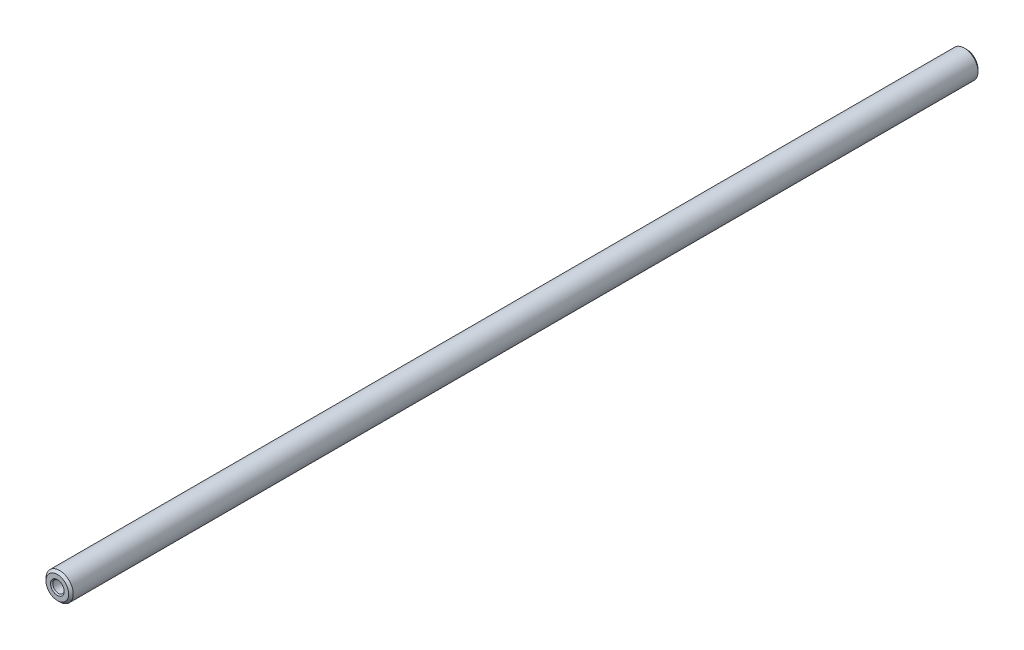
ISO-10303-21;
HEADER;
FILE_DESCRIPTION(('STEP AP214'),'2;1');
FILE_NAME('part.step','',(''),(''),'','','');
FILE_SCHEMA(('AUTOMOTIVE_DESIGN { 1 0 10303 214 1 1 1 1 }'));
ENDSEC;
DATA;
#1=APPLICATION_CONTEXT('core data for automotive mechanical design processes');
#2=APPLICATION_PROTOCOL_DEFINITION('international standard','automotive_design',2000,#1);
#3=PRODUCT_CONTEXT('',#1,'mechanical');
#4=PRODUCT('Part','Part','',(#3));
#5=PRODUCT_RELATED_PRODUCT_CATEGORY('part','',(#4));
#6=PRODUCT_DEFINITION_FORMATION('','',#4);
#7=PRODUCT_DEFINITION_CONTEXT('part definition',#1,'design');
#8=PRODUCT_DEFINITION('design','',#6,#7);
#9=PRODUCT_DEFINITION_SHAPE('','',#8);
#10=(LENGTH_UNIT() NAMED_UNIT(*) SI_UNIT(.MILLI.,.METRE.));
#11=(NAMED_UNIT(*) PLANE_ANGLE_UNIT() SI_UNIT($,.RADIAN.));
#12=(NAMED_UNIT(*) SI_UNIT($,.STERADIAN.) SOLID_ANGLE_UNIT());
#13=UNCERTAINTY_MEASURE_WITH_UNIT(LENGTH_MEASURE(1.E-05),#10,'distance_accuracy_value','');
#14=(GEOMETRIC_REPRESENTATION_CONTEXT(3) GLOBAL_UNCERTAINTY_ASSIGNED_CONTEXT((#13)) GLOBAL_UNIT_ASSIGNED_CONTEXT((#10,
#11,#12)) REPRESENTATION_CONTEXT('',''));
#15=CARTESIAN_POINT('',(0.,0.,0.));
#16=DIRECTION('',(0.,0.,1.));
#17=DIRECTION('',(1.,0.,0.));
#18=AXIS2_PLACEMENT_3D('',#15,#16,#17);
#19=CARTESIAN_POINT('',(0.,0.,200.));
#20=DIRECTION('',(0.,0.,-1.));
#21=DIRECTION('',(-1.,0.,0.));
#22=AXIS2_PLACEMENT_3D('',#19,#20,#21);
#23=CYLINDRICAL_SURFACE('',#22,2.995);
#24=CARTESIAN_POINT('',(0.,0.,0.500000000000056));
#25=DIRECTION('',(0.,0.,1.));
#26=DIRECTION('',(1.,0.,0.));
#27=AXIS2_PLACEMENT_3D('',#24,#25,#26);
#28=CIRCLE('',#27,2.995);
#29=CARTESIAN_POINT('',(2.995,0.,0.500000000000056));
#30=VERTEX_POINT('',#29);
#31=EDGE_CURVE('E119',#30,#30,#28,.T.);
#32=ORIENTED_EDGE('',*,*,#31,.T.);
#33=EDGE_LOOP('',(#32));
#34=FACE_BOUND('',#33,.T.);
#35=CARTESIAN_POINT('',(0.,0.,199.5));
#36=DIRECTION('',(0.,0.,1.));
#37=DIRECTION('',(1.,0.,0.));
#38=AXIS2_PLACEMENT_3D('',#35,#36,#37);
#39=CIRCLE('',#38,2.995);
#40=CARTESIAN_POINT('',(2.995,0.,199.5));
#41=VERTEX_POINT('',#40);
#42=EDGE_CURVE('E116',#41,#41,#39,.F.);
#43=ORIENTED_EDGE('',*,*,#42,.T.);
#44=EDGE_LOOP('',(#43));
#45=FACE_BOUND('',#44,.T.);
#46=ADVANCED_FACE('F76',(#34,#45),#23,.T.);
#47=CARTESIAN_POINT('',(0.,0.,200.));
#48=DIRECTION('',(0.,0.,1.));
#49=DIRECTION('',(1.,0.,0.));
#50=AXIS2_PLACEMENT_3D('',#47,#48,#49);
#51=PLANE('',#50);
#52=CARTESIAN_POINT('',(0.,0.,200.));
#53=DIRECTION('',(0.,0.,1.));
#54=DIRECTION('',(1.,0.,0.));
#55=AXIS2_PLACEMENT_3D('',#52,#53,#54);
#56=CIRCLE('',#55,1.5);
#57=CARTESIAN_POINT('',(1.5,0.,200.));
#58=VERTEX_POINT('',#57);
#59=EDGE_CURVE('E107',#58,#58,#56,.T.);
#60=ORIENTED_EDGE('',*,*,#59,.F.);
#61=EDGE_LOOP('',(#60));
#62=FACE_BOUND('',#61,.T.);
#63=CARTESIAN_POINT('',(0.,0.,200.));
#64=DIRECTION('',(0.,0.,1.));
#65=DIRECTION('',(1.,0.,0.));
#66=AXIS2_PLACEMENT_3D('',#63,#64,#65);
#67=CIRCLE('',#66,2.495);
#68=CARTESIAN_POINT('',(2.495,0.,200.));
#69=VERTEX_POINT('',#68);
#70=EDGE_CURVE('E12',#69,#69,#67,.T.);
#71=ORIENTED_EDGE('',*,*,#70,.T.);
#72=EDGE_LOOP('',(#71));
#73=FACE_BOUND('',#72,.T.);
#74=ADVANCED_FACE('F133',(#62,#73),#51,.T.);
#75=CARTESIAN_POINT('',(0.,0.,0.));
#76=DIRECTION('',(0.,0.,1.));
#77=DIRECTION('',(1.,0.,0.));
#78=AXIS2_PLACEMENT_3D('',#75,#76,#77);
#79=PLANE('',#78);
#80=CARTESIAN_POINT('',(0.,0.,0.));
#81=DIRECTION('',(0.,0.,-1.));
#82=DIRECTION('',(-1.,0.,0.));
#83=AXIS2_PLACEMENT_3D('',#80,#81,#82);
#84=CIRCLE('',#83,1.5);
#85=CARTESIAN_POINT('',(-1.5,0.,0.));
#86=VERTEX_POINT('',#85);
#87=EDGE_CURVE('E100',#86,#86,#84,.T.);
#88=ORIENTED_EDGE('',*,*,#87,.F.);
#89=EDGE_LOOP('',(#88));
#90=FACE_BOUND('',#89,.T.);
#91=CARTESIAN_POINT('',(0.,0.,0.));
#92=DIRECTION('',(0.,0.,1.));
#93=DIRECTION('',(1.,0.,0.));
#94=AXIS2_PLACEMENT_3D('',#91,#92,#93);
#95=CIRCLE('',#94,2.49499999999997);
#96=CARTESIAN_POINT('',(2.49499999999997,0.,0.));
#97=VERTEX_POINT('',#96);
#98=EDGE_CURVE('E84',#97,#97,#95,.F.);
#99=ORIENTED_EDGE('',*,*,#98,.T.);
#100=EDGE_LOOP('',(#99));
#101=FACE_BOUND('',#100,.T.);
#102=ADVANCED_FACE('F124',(#90,#101),#79,.F.);
#103=CARTESIAN_POINT('',(0.,0.,0.500000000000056));
#104=DIRECTION('',(0.,0.,1.));
#105=DIRECTION('',(1.,0.,0.));
#106=AXIS2_PLACEMENT_3D('',#103,#104,#105);
#107=CONICAL_SURFACE('',#106,2.995,0.785398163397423);
#108=ORIENTED_EDGE('',*,*,#98,.F.);
#109=EDGE_LOOP('',(#108));
#110=FACE_BOUND('',#109,.T.);
#111=ORIENTED_EDGE('',*,*,#31,.F.);
#112=EDGE_LOOP('',(#111));
#113=FACE_BOUND('',#112,.T.);
#114=ADVANCED_FACE('F126',(#110,#113),#107,.T.);
#115=CARTESIAN_POINT('',(0.,0.,200.));
#116=DIRECTION('',(0.,0.,-1.));
#117=DIRECTION('',(-1.,0.,0.));
#118=AXIS2_PLACEMENT_3D('',#115,#116,#117);
#119=CONICAL_SURFACE('',#118,2.495,0.785398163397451);
#120=ORIENTED_EDGE('',*,*,#42,.F.);
#121=EDGE_LOOP('',(#120));
#122=FACE_BOUND('',#121,.T.);
#123=ORIENTED_EDGE('',*,*,#70,.F.);
#124=EDGE_LOOP('',(#123));
#125=FACE_BOUND('',#124,.T.);
#126=ADVANCED_FACE('F78',(#122,#125),#119,.T.);
#127=CARTESIAN_POINT('',(0.,0.,3.));
#128=DIRECTION('',(0.,0.,-1.));
#129=DIRECTION('',(-1.,0.,0.));
#130=AXIS2_PLACEMENT_3D('',#127,#128,#129);
#131=CONICAL_SURFACE('',#130,1.25,1.02974425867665);
#132=CARTESIAN_POINT('',(0.,0.,3.75107577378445));
#133=VERTEX_POINT('',#132);
#134=VERTEX_LOOP('',#133);
#135=FACE_BOUND('',#134,.T.);
#136=CARTESIAN_POINT('',(0.,0.,3.));
#137=DIRECTION('',(0.,0.,-1.));
#138=DIRECTION('',(-1.,0.,0.));
#139=AXIS2_PLACEMENT_3D('',#136,#137,#138);
#140=CIRCLE('',#139,1.25);
#141=CARTESIAN_POINT('',(-1.25,0.,3.));
#142=VERTEX_POINT('',#141);
#143=EDGE_CURVE('E113',#142,#142,#140,.T.);
#144=ORIENTED_EDGE('',*,*,#143,.T.);
#145=EDGE_LOOP('',(#144));
#146=FACE_BOUND('',#145,.T.);
#147=ADVANCED_FACE('F139',(#135,#146),#131,.F.);
#148=CARTESIAN_POINT('',(0.,0.,0.));
#149=DIRECTION('',(0.,0.,-1.));
#150=DIRECTION('',(-1.,0.,0.));
#151=AXIS2_PLACEMENT_3D('',#148,#149,#150);
#152=CYLINDRICAL_SURFACE('',#151,1.24999999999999);
#153=ORIENTED_EDGE('',*,*,#143,.F.);
#154=EDGE_LOOP('',(#153));
#155=FACE_BOUND('',#154,.T.);
#156=CARTESIAN_POINT('',(0.,0.,0.25));
#157=DIRECTION('',(0.,0.,-1.));
#158=DIRECTION('',(-1.,0.,0.));
#159=AXIS2_PLACEMENT_3D('',#156,#157,#158);
#160=CIRCLE('',#159,1.24999999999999);
#161=CARTESIAN_POINT('',(-1.24999999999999,0.,0.25));
#162=VERTEX_POINT('',#161);
#163=EDGE_CURVE('E104',#162,#162,#160,.T.);
#164=ORIENTED_EDGE('',*,*,#163,.T.);
#165=EDGE_LOOP('',(#164));
#166=FACE_BOUND('',#165,.T.);
#167=ADVANCED_FACE('F154',(#155,#166),#152,.F.);
#168=CARTESIAN_POINT('',(0.,0.,0.));
#169=DIRECTION('',(0.,0.,-1.));
#170=DIRECTION('',(-1.,0.,0.));
#171=AXIS2_PLACEMENT_3D('',#168,#169,#170);
#172=CONICAL_SURFACE('',#171,1.5,0.785398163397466);
#173=ORIENTED_EDGE('',*,*,#163,.F.);
#174=EDGE_LOOP('',(#173));
#175=FACE_BOUND('',#174,.T.);
#176=ORIENTED_EDGE('',*,*,#87,.T.);
#177=EDGE_LOOP('',(#176));
#178=FACE_BOUND('',#177,.T.);
#179=ADVANCED_FACE('F94',(#175,#178),#172,.F.);
#180=CARTESIAN_POINT('',(0.,0.,197.));
#181=DIRECTION('',(0.,0.,1.));
#182=DIRECTION('',(1.,0.,0.));
#183=AXIS2_PLACEMENT_3D('',#180,#181,#182);
#184=CONICAL_SURFACE('',#183,1.25,1.02974425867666);
#185=CARTESIAN_POINT('',(0.,0.,196.248924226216));
#186=VERTEX_POINT('',#185);
#187=VERTEX_LOOP('',#186);
#188=FACE_BOUND('',#187,.T.);
#189=CARTESIAN_POINT('',(0.,0.,197.));
#190=DIRECTION('',(0.,0.,1.));
#191=DIRECTION('',(1.,0.,0.));
#192=AXIS2_PLACEMENT_3D('',#189,#190,#191);
#193=CIRCLE('',#192,1.25);
#194=CARTESIAN_POINT('',(1.25,0.,197.));
#195=VERTEX_POINT('',#194);
#196=EDGE_CURVE('E98',#195,#195,#193,.T.);
#197=ORIENTED_EDGE('',*,*,#196,.T.);
#198=EDGE_LOOP('',(#197));
#199=FACE_BOUND('',#198,.T.);
#200=ADVANCED_FACE('F90',(#188,#199),#184,.F.);
#201=CARTESIAN_POINT('',(0.,0.,200.));
#202=DIRECTION('',(0.,0.,1.));
#203=DIRECTION('',(1.,0.,0.));
#204=AXIS2_PLACEMENT_3D('',#201,#202,#203);
#205=CYLINDRICAL_SURFACE('',#204,1.24999999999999);
#206=ORIENTED_EDGE('',*,*,#196,.F.);
#207=EDGE_LOOP('',(#206));
#208=FACE_BOUND('',#207,.T.);
#209=CARTESIAN_POINT('',(0.,0.,199.75));
#210=DIRECTION('',(0.,0.,1.));
#211=DIRECTION('',(1.,0.,0.));
#212=AXIS2_PLACEMENT_3D('',#209,#210,#211);
#213=CIRCLE('',#212,1.24999999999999);
#214=CARTESIAN_POINT('',(1.24999999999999,0.,199.75));
#215=VERTEX_POINT('',#214);
#216=EDGE_CURVE('E101',#215,#215,#213,.T.);
#217=ORIENTED_EDGE('',*,*,#216,.T.);
#218=EDGE_LOOP('',(#217));
#219=FACE_BOUND('',#218,.T.);
#220=ADVANCED_FACE('F93',(#208,#219),#205,.F.);
#221=CARTESIAN_POINT('',(0.,0.,200.));
#222=DIRECTION('',(0.,0.,1.));
#223=DIRECTION('',(1.,0.,0.));
#224=AXIS2_PLACEMENT_3D('',#221,#222,#223);
#225=CONICAL_SURFACE('',#224,1.5,0.785398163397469);
#226=ORIENTED_EDGE('',*,*,#216,.F.);
#227=EDGE_LOOP('',(#226));
#228=FACE_BOUND('',#227,.T.);
#229=ORIENTED_EDGE('',*,*,#59,.T.);
#230=EDGE_LOOP('',(#229));
#231=FACE_BOUND('',#230,.T.);
#232=ADVANCED_FACE('F163',(#228,#231),#225,.F.);
#233=CLOSED_SHELL('',(#46,#74,#102,#114,#126,#147,#167,#179,#200,#220,#232));
#234=MANIFOLD_SOLID_BREP('B2',#233);
#235=ADVANCED_BREP_SHAPE_REPRESENTATION('',(#18,#234),#14);
#236=SHAPE_DEFINITION_REPRESENTATION(#9,#235);
ENDSEC;
END-ISO-10303-21;
